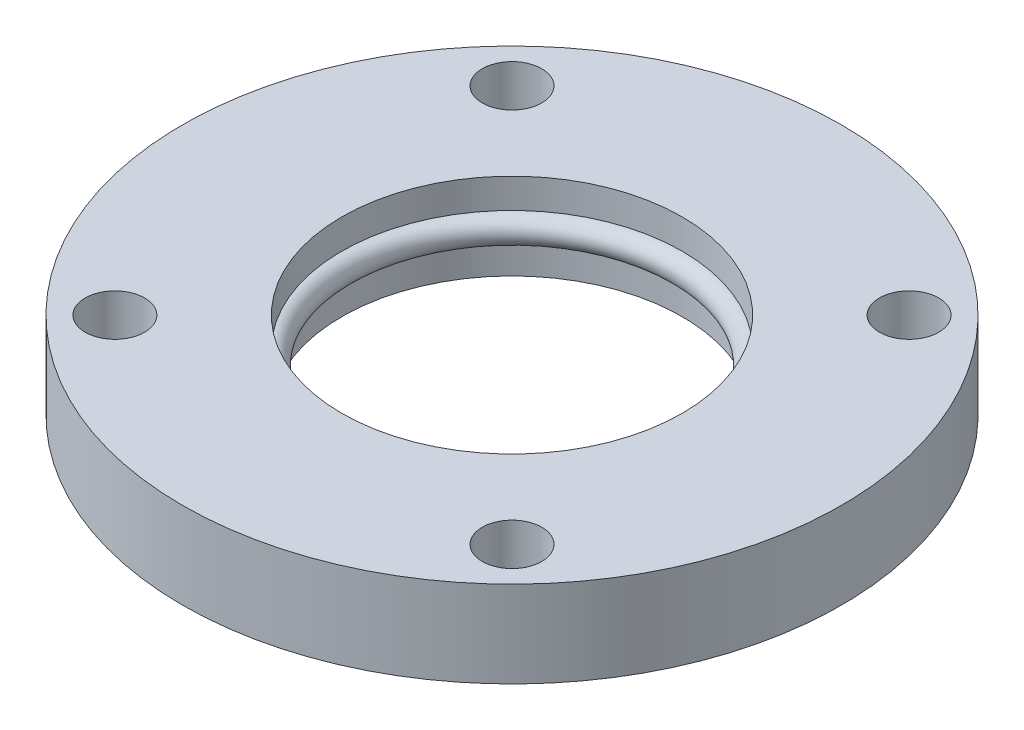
ISO-10303-21;
HEADER;
FILE_DESCRIPTION(('STEP AP214'),'2;1');
FILE_NAME('part.step','',(''),(''),'','','');
FILE_SCHEMA(('AUTOMOTIVE_DESIGN { 1 0 10303 214 1 1 1 1 }'));
ENDSEC;
DATA;
#1=APPLICATION_CONTEXT('core data for automotive mechanical design processes');
#2=APPLICATION_PROTOCOL_DEFINITION('international standard','automotive_design',2000,#1);
#3=PRODUCT_CONTEXT('',#1,'mechanical');
#4=PRODUCT('Part','Part','',(#3));
#5=PRODUCT_RELATED_PRODUCT_CATEGORY('part','',(#4));
#6=PRODUCT_DEFINITION_FORMATION('','',#4);
#7=PRODUCT_DEFINITION_CONTEXT('part definition',#1,'design');
#8=PRODUCT_DEFINITION('design','',#6,#7);
#9=PRODUCT_DEFINITION_SHAPE('','',#8);
#10=(LENGTH_UNIT() NAMED_UNIT(*) SI_UNIT(.MILLI.,.METRE.));
#11=(NAMED_UNIT(*) PLANE_ANGLE_UNIT() SI_UNIT($,.RADIAN.));
#12=(NAMED_UNIT(*) SI_UNIT($,.STERADIAN.) SOLID_ANGLE_UNIT());
#13=UNCERTAINTY_MEASURE_WITH_UNIT(LENGTH_MEASURE(1.E-05),#10,'distance_accuracy_value','');
#14=(GEOMETRIC_REPRESENTATION_CONTEXT(3) GLOBAL_UNCERTAINTY_ASSIGNED_CONTEXT((#13)) GLOBAL_UNIT_ASSIGNED_CONTEXT((#10,
#11,#12)) REPRESENTATION_CONTEXT('',''));
#15=CARTESIAN_POINT('',(0.,0.,0.));
#16=DIRECTION('',(0.,0.,1.));
#17=DIRECTION('',(1.,0.,0.));
#18=AXIS2_PLACEMENT_3D('',#15,#16,#17);
#19=CARTESIAN_POINT('',(0.,8.,0.));
#20=DIRECTION('',(0.,-1.,0.));
#21=DIRECTION('',(0.,0.,-1.));
#22=AXIS2_PLACEMENT_3D('',#19,#20,#21);
#23=CYLINDRICAL_SURFACE('',#22,31.5);
#24=CARTESIAN_POINT('',(0.,-8.,0.));
#25=DIRECTION('',(0.,1.,0.));
#26=DIRECTION('',(0.,0.,1.));
#27=AXIS2_PLACEMENT_3D('',#24,#25,#26);
#28=CIRCLE('',#27,31.5);
#29=CARTESIAN_POINT('',(0.,-8.,31.5));
#30=VERTEX_POINT('',#29);
#31=EDGE_CURVE('E48',#30,#30,#28,.T.);
#32=ORIENTED_EDGE('',*,*,#31,.F.);
#33=EDGE_LOOP('',(#32));
#34=FACE_BOUND('',#33,.T.);
#35=CARTESIAN_POINT('',(0.,-2.5,0.));
#36=DIRECTION('',(0.,1.,0.));
#37=DIRECTION('',(0.,0.,1.));
#38=AXIS2_PLACEMENT_3D('',#35,#36,#37);
#39=CIRCLE('',#38,31.5);
#40=CARTESIAN_POINT('',(0.,-2.5,31.5));
#41=VERTEX_POINT('',#40);
#42=EDGE_CURVE('E36',#41,#41,#39,.T.);
#43=ORIENTED_EDGE('',*,*,#42,.T.);
#44=EDGE_LOOP('',(#43));
#45=FACE_BOUND('',#44,.T.);
#46=ADVANCED_FACE('F32',(#34,#45),#23,.F.);
#47=CARTESIAN_POINT('',(0.,8.,0.));
#48=DIRECTION('',(0.,1.,0.));
#49=DIRECTION('',(0.,0.,1.));
#50=AXIS2_PLACEMENT_3D('',#47,#48,#49);
#51=CIRCLE('',#50,31.5);
#52=CARTESIAN_POINT('',(0.,8.,31.5));
#53=VERTEX_POINT('',#52);
#54=EDGE_CURVE('E45',#53,#53,#51,.T.);
#55=ORIENTED_EDGE('',*,*,#54,.T.);
#56=EDGE_LOOP('',(#55));
#57=FACE_BOUND('',#56,.T.);
#58=CARTESIAN_POINT('',(0.,2.5,0.));
#59=DIRECTION('',(0.,-1.,0.));
#60=DIRECTION('',(0.,0.,-1.));
#61=AXIS2_PLACEMENT_3D('',#58,#59,#60);
#62=CIRCLE('',#61,31.5);
#63=CARTESIAN_POINT('',(0.,2.5,-31.5));
#64=VERTEX_POINT('',#63);
#65=EDGE_CURVE('E50',#64,#64,#62,.T.);
#66=ORIENTED_EDGE('',*,*,#65,.T.);
#67=EDGE_LOOP('',(#66));
#68=FACE_BOUND('',#67,.T.);
#69=ADVANCED_FACE('F93',(#57,#68),#23,.F.);
#70=CARTESIAN_POINT('',(0.,8.,0.));
#71=DIRECTION('',(0.,1.,0.));
#72=DIRECTION('',(0.,0.,1.));
#73=AXIS2_PLACEMENT_3D('',#70,#71,#72);
#74=PLANE('',#73);
#75=CARTESIAN_POINT('',(36.75,8.,36.75));
#76=DIRECTION('',(0.,1.,0.));
#77=DIRECTION('',(0.,0.,1.));
#78=AXIS2_PLACEMENT_3D('',#75,#76,#77);
#79=CIRCLE('',#78,5.5);
#80=CARTESIAN_POINT('',(36.75,8.,42.25));
#81=VERTEX_POINT('',#80);
#82=EDGE_CURVE('E67',#81,#81,#79,.T.);
#83=ORIENTED_EDGE('',*,*,#82,.F.);
#84=EDGE_LOOP('',(#83));
#85=FACE_BOUND('',#84,.T.);
#86=CARTESIAN_POINT('',(-36.75,8.,-36.75));
#87=DIRECTION('',(0.,1.,0.));
#88=DIRECTION('',(0.,0.,1.));
#89=AXIS2_PLACEMENT_3D('',#86,#87,#88);
#90=CIRCLE('',#89,5.5);
#91=CARTESIAN_POINT('',(-36.75,8.,-31.25));
#92=VERTEX_POINT('',#91);
#93=EDGE_CURVE('E79',#92,#92,#90,.T.);
#94=ORIENTED_EDGE('',*,*,#93,.F.);
#95=EDGE_LOOP('',(#94));
#96=FACE_BOUND('',#95,.T.);
#97=CARTESIAN_POINT('',(0.,8.,0.));
#98=DIRECTION('',(0.,1.,0.));
#99=DIRECTION('',(0.,0.,1.));
#100=AXIS2_PLACEMENT_3D('',#97,#98,#99);
#101=CIRCLE('',#100,61.);
#102=CARTESIAN_POINT('',(0.,8.,61.));
#103=VERTEX_POINT('',#102);
#104=EDGE_CURVE('E10',#103,#103,#101,.T.);
#105=ORIENTED_EDGE('',*,*,#104,.T.);
#106=EDGE_LOOP('',(#105));
#107=FACE_BOUND('',#106,.T.);
#108=ORIENTED_EDGE('',*,*,#54,.F.);
#109=EDGE_LOOP('',(#108));
#110=FACE_BOUND('',#109,.T.);
#111=CARTESIAN_POINT('',(36.75,8.,-36.75));
#112=DIRECTION('',(0.,1.,0.));
#113=DIRECTION('',(0.,0.,1.));
#114=AXIS2_PLACEMENT_3D('',#111,#112,#113);
#115=CIRCLE('',#114,5.5);
#116=CARTESIAN_POINT('',(36.75,8.,-31.25));
#117=VERTEX_POINT('',#116);
#118=EDGE_CURVE('E73',#117,#117,#115,.T.);
#119=ORIENTED_EDGE('',*,*,#118,.F.);
#120=EDGE_LOOP('',(#119));
#121=FACE_BOUND('',#120,.T.);
#122=CARTESIAN_POINT('',(-36.75,8.,36.75));
#123=DIRECTION('',(0.,1.,0.));
#124=DIRECTION('',(0.,0.,1.));
#125=AXIS2_PLACEMENT_3D('',#122,#123,#124);
#126=CIRCLE('',#125,5.5);
#127=CARTESIAN_POINT('',(-36.75,8.,42.25));
#128=VERTEX_POINT('',#127);
#129=EDGE_CURVE('E59',#128,#128,#126,.T.);
#130=ORIENTED_EDGE('',*,*,#129,.F.);
#131=EDGE_LOOP('',(#130));
#132=FACE_BOUND('',#131,.T.);
#133=ADVANCED_FACE('F98',(#85,#96,#107,#110,#121,#132),#74,.T.);
#134=CARTESIAN_POINT('',(0.,-8.,0.));
#135=DIRECTION('',(0.,1.,0.));
#136=DIRECTION('',(0.,0.,1.));
#137=AXIS2_PLACEMENT_3D('',#134,#135,#136);
#138=PLANE('',#137);
#139=CARTESIAN_POINT('',(0.,-8.,0.));
#140=DIRECTION('',(0.,1.,0.));
#141=DIRECTION('',(0.,0.,1.));
#142=AXIS2_PLACEMENT_3D('',#139,#140,#141);
#143=CIRCLE('',#142,61.);
#144=CARTESIAN_POINT('',(0.,-8.,61.));
#145=VERTEX_POINT('',#144);
#146=EDGE_CURVE('E40',#145,#145,#143,.T.);
#147=ORIENTED_EDGE('',*,*,#146,.F.);
#148=EDGE_LOOP('',(#147));
#149=FACE_BOUND('',#148,.T.);
#150=ORIENTED_EDGE('',*,*,#31,.T.);
#151=EDGE_LOOP('',(#150));
#152=FACE_BOUND('',#151,.T.);
#153=CARTESIAN_POINT('',(-36.75,-8.,-36.75));
#154=DIRECTION('',(0.,1.,0.));
#155=DIRECTION('',(0.,0.,1.));
#156=AXIS2_PLACEMENT_3D('',#153,#154,#155);
#157=CIRCLE('',#156,5.5);
#158=CARTESIAN_POINT('',(-36.75,-8.,-31.25));
#159=VERTEX_POINT('',#158);
#160=EDGE_CURVE('E76',#159,#159,#157,.T.);
#161=ORIENTED_EDGE('',*,*,#160,.T.);
#162=EDGE_LOOP('',(#161));
#163=FACE_BOUND('',#162,.T.);
#164=CARTESIAN_POINT('',(36.75,-8.,-36.75));
#165=DIRECTION('',(0.,1.,0.));
#166=DIRECTION('',(0.,0.,1.));
#167=AXIS2_PLACEMENT_3D('',#164,#165,#166);
#168=CIRCLE('',#167,5.5);
#169=CARTESIAN_POINT('',(36.75,-8.,-31.25));
#170=VERTEX_POINT('',#169);
#171=EDGE_CURVE('E70',#170,#170,#168,.T.);
#172=ORIENTED_EDGE('',*,*,#171,.T.);
#173=EDGE_LOOP('',(#172));
#174=FACE_BOUND('',#173,.T.);
#175=CARTESIAN_POINT('',(36.75,-8.,36.75));
#176=DIRECTION('',(0.,1.,0.));
#177=DIRECTION('',(0.,0.,1.));
#178=AXIS2_PLACEMENT_3D('',#175,#176,#177);
#179=CIRCLE('',#178,5.5);
#180=CARTESIAN_POINT('',(36.75,-8.,42.25));
#181=VERTEX_POINT('',#180);
#182=EDGE_CURVE('E64',#181,#181,#179,.T.);
#183=ORIENTED_EDGE('',*,*,#182,.T.);
#184=EDGE_LOOP('',(#183));
#185=FACE_BOUND('',#184,.T.);
#186=CARTESIAN_POINT('',(-36.75,-8.,36.75));
#187=DIRECTION('',(0.,1.,0.));
#188=DIRECTION('',(0.,0.,1.));
#189=AXIS2_PLACEMENT_3D('',#186,#187,#188);
#190=CIRCLE('',#189,5.5);
#191=CARTESIAN_POINT('',(-36.75,-8.,42.25));
#192=VERTEX_POINT('',#191);
#193=EDGE_CURVE('E55',#192,#192,#190,.T.);
#194=ORIENTED_EDGE('',*,*,#193,.T.);
#195=EDGE_LOOP('',(#194));
#196=FACE_BOUND('',#195,.T.);
#197=ADVANCED_FACE('F89',(#149,#152,#163,#174,#185,#196),#138,.F.);
#198=CARTESIAN_POINT('',(0.,8.,0.));
#199=DIRECTION('',(0.,-1.,0.));
#200=DIRECTION('',(0.,0.,-1.));
#201=AXIS2_PLACEMENT_3D('',#198,#199,#200);
#202=CYLINDRICAL_SURFACE('',#201,61.);
#203=ORIENTED_EDGE('',*,*,#104,.F.);
#204=EDGE_LOOP('',(#203));
#205=FACE_BOUND('',#204,.T.);
#206=ORIENTED_EDGE('',*,*,#146,.T.);
#207=EDGE_LOOP('',(#206));
#208=FACE_BOUND('',#207,.T.);
#209=ADVANCED_FACE('F34',(#205,#208),#202,.T.);
#210=CARTESIAN_POINT('',(-36.75,8.,-36.75));
#211=DIRECTION('',(0.,-1.,0.));
#212=DIRECTION('',(0.,0.,-1.));
#213=AXIS2_PLACEMENT_3D('',#210,#211,#212);
#214=CYLINDRICAL_SURFACE('',#213,5.5);
#215=ORIENTED_EDGE('',*,*,#93,.T.);
#216=EDGE_LOOP('',(#215));
#217=FACE_BOUND('',#216,.T.);
#218=ORIENTED_EDGE('',*,*,#160,.F.);
#219=EDGE_LOOP('',(#218));
#220=FACE_BOUND('',#219,.T.);
#221=ADVANCED_FACE('F101',(#217,#220),#214,.F.);
#222=CARTESIAN_POINT('',(36.75,8.,-36.75));
#223=DIRECTION('',(0.,-1.,0.));
#224=DIRECTION('',(0.,0.,-1.));
#225=AXIS2_PLACEMENT_3D('',#222,#223,#224);
#226=CYLINDRICAL_SURFACE('',#225,5.5);
#227=ORIENTED_EDGE('',*,*,#118,.T.);
#228=EDGE_LOOP('',(#227));
#229=FACE_BOUND('',#228,.T.);
#230=ORIENTED_EDGE('',*,*,#171,.F.);
#231=EDGE_LOOP('',(#230));
#232=FACE_BOUND('',#231,.T.);
#233=ADVANCED_FACE('F116',(#229,#232),#226,.F.);
#234=CARTESIAN_POINT('',(36.75,8.,36.75));
#235=DIRECTION('',(0.,-1.,0.));
#236=DIRECTION('',(0.,0.,-1.));
#237=AXIS2_PLACEMENT_3D('',#234,#235,#236);
#238=CYLINDRICAL_SURFACE('',#237,5.5);
#239=ORIENTED_EDGE('',*,*,#82,.T.);
#240=EDGE_LOOP('',(#239));
#241=FACE_BOUND('',#240,.T.);
#242=ORIENTED_EDGE('',*,*,#182,.F.);
#243=EDGE_LOOP('',(#242));
#244=FACE_BOUND('',#243,.T.);
#245=ADVANCED_FACE('F121',(#241,#244),#238,.F.);
#246=CARTESIAN_POINT('',(-36.75,8.,36.75));
#247=DIRECTION('',(0.,-1.,0.));
#248=DIRECTION('',(0.,0.,-1.));
#249=AXIS2_PLACEMENT_3D('',#246,#247,#248);
#250=CYLINDRICAL_SURFACE('',#249,5.5);
#251=ORIENTED_EDGE('',*,*,#129,.T.);
#252=EDGE_LOOP('',(#251));
#253=FACE_BOUND('',#252,.T.);
#254=ORIENTED_EDGE('',*,*,#193,.F.);
#255=EDGE_LOOP('',(#254));
#256=FACE_BOUND('',#255,.T.);
#257=ADVANCED_FACE('F132',(#253,#256),#250,.F.);
#258=CARTESIAN_POINT('',(0.,0.,0.));
#259=DIRECTION('',(0.,-1.,0.));
#260=DIRECTION('',(0.,0.,-1.));
#261=AXIS2_PLACEMENT_3D('',#258,#259,#260);
#262=TOROIDAL_SURFACE('',#261,31.5,2.5);
#263=ORIENTED_EDGE('',*,*,#65,.F.);
#264=EDGE_LOOP('',(#263));
#265=FACE_BOUND('',#264,.T.);
#266=ORIENTED_EDGE('',*,*,#42,.F.);
#267=EDGE_LOOP('',(#266));
#268=FACE_BOUND('',#267,.T.);
#269=ADVANCED_FACE('F138',(#265,#268),#262,.T.);
#270=CLOSED_SHELL('',(#46,#69,#133,#197,#209,#221,#233,#245,#257,#269));
#271=MANIFOLD_SOLID_BREP('B2',#270);
#272=ADVANCED_BREP_SHAPE_REPRESENTATION('',(#18,#271),#14);
#273=SHAPE_DEFINITION_REPRESENTATION(#9,#272);
ENDSEC;
END-ISO-10303-21;
